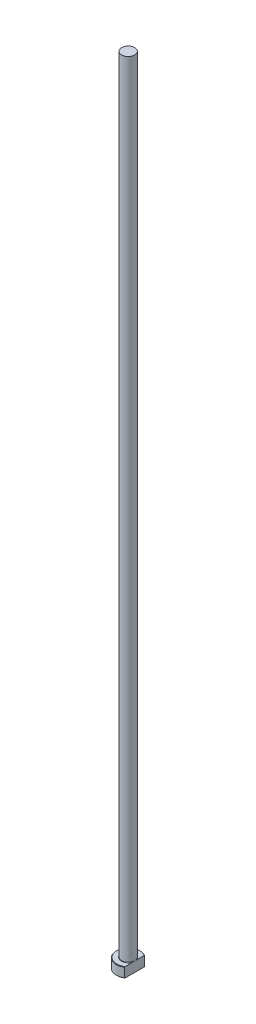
from build123d import *
from build123d.topology import SkipClean

# Parameters (mm, degrees)
CHAMFER1_SIZE = 0.2
FILLET1_R     = 0.2
KEY_DEPTH     = 401.089989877


with BuildPart() as part:
    # Sketch1 → Revolve1 (revolve)
    with BuildSketch(Plane.XY, mode=Mode.PRIVATE) as revolve1_sk:
        Polygon((0, 0), (-6, 0), (-6, 5), (-3.25, 5), (-3.25, 400), (0, 400), align=None)
    revolve(revolve1_sk.sketch.rotate(Axis((0, 259.958771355, 0), (0, -1, 0)), 270), axis=Axis((0, 259.958771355, 0), (0, -1, 0)))

    # Chamfer1
    chamfer1_edges = [part.edges().sort_by_distance(p)[0] for p in [
        (0, 5, -6),
        (0, 0, -6),
    ]]
    chamfer(chamfer1_edges, length=CHAMFER1_SIZE)

    # Fillet1
    fillet1_edges = [part.edges().sort_by_distance(p)[0] for p in [
        (0, 5, -3.25),
    ]]
    fillet(fillet1_edges, radius=FILLET1_R)

    # Sketch2 → KEY (cut, through all)
    with SkipClean():  # the faces are left unmerged after this step: merging them gives an invalid solid
        with BuildSketch(Plane(origin=(0, 0, 0), x_dir=(1, 0, 0), z_dir=(0, 1, 0))):
            with BuildLine():
                Line((3.25, 5.04356025), (3.25, -5.04356025))
                ThreePointArc((3.25, -5.04356025), (6, 0), (3.25, 5.04356025))
            make_face()
        extrude(amount=KEY_DEPTH, mode=Mode.SUBTRACT)


solid = part.part
